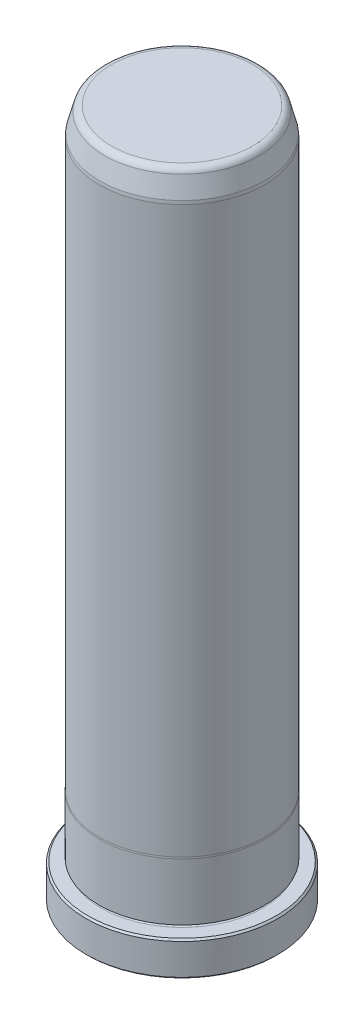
ISO-10303-21;
HEADER;
FILE_DESCRIPTION(('STEP AP214'),'2;1');
FILE_NAME('part.step','',(''),(''),'','','');
FILE_SCHEMA(('AUTOMOTIVE_DESIGN { 1 0 10303 214 1 1 1 1 }'));
ENDSEC;
DATA;
#1=APPLICATION_CONTEXT('core data for automotive mechanical design processes');
#2=APPLICATION_PROTOCOL_DEFINITION('international standard','automotive_design',2000,#1);
#3=PRODUCT_CONTEXT('',#1,'mechanical');
#4=PRODUCT('Part','Part','',(#3));
#5=PRODUCT_RELATED_PRODUCT_CATEGORY('part','',(#4));
#6=PRODUCT_DEFINITION_FORMATION('','',#4);
#7=PRODUCT_DEFINITION_CONTEXT('part definition',#1,'design');
#8=PRODUCT_DEFINITION('design','',#6,#7);
#9=PRODUCT_DEFINITION_SHAPE('','',#8);
#10=(LENGTH_UNIT() NAMED_UNIT(*) SI_UNIT(.MILLI.,.METRE.));
#11=(NAMED_UNIT(*) PLANE_ANGLE_UNIT() SI_UNIT($,.RADIAN.));
#12=(NAMED_UNIT(*) SI_UNIT($,.STERADIAN.) SOLID_ANGLE_UNIT());
#13=UNCERTAINTY_MEASURE_WITH_UNIT(LENGTH_MEASURE(1.E-05),#10,'distance_accuracy_value','');
#14=(GEOMETRIC_REPRESENTATION_CONTEXT(3) GLOBAL_UNCERTAINTY_ASSIGNED_CONTEXT((#13)) GLOBAL_UNIT_ASSIGNED_CONTEXT((#10,
#11,#12)) REPRESENTATION_CONTEXT('',''));
#15=CARTESIAN_POINT('',(0.,0.,0.));
#16=DIRECTION('',(0.,0.,1.));
#17=DIRECTION('',(1.,0.,0.));
#18=AXIS2_PLACEMENT_3D('',#15,#16,#17);
#19=CARTESIAN_POINT('',(0.,-1.15498161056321E-13,0.));
#20=DIRECTION('',(0.,1.,0.));
#21=DIRECTION('',(0.,0.,1.));
#22=AXIS2_PLACEMENT_3D('',#19,#20,#21);
#23=PLANE('',#22);
#24=CARTESIAN_POINT('',(0.,-1.15498161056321E-13,0.));
#25=DIRECTION('',(0.,1.,0.));
#26=DIRECTION('',(0.,0.,1.));
#27=AXIS2_PLACEMENT_3D('',#24,#25,#26);
#28=CIRCLE('',#27,21.7170000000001);
#29=CARTESIAN_POINT('',(0.,-3.42511787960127E-13,21.7170000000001));
#30=VERTEX_POINT('',#29);
#31=EDGE_CURVE('E37',#30,#30,#28,.F.);
#32=ORIENTED_EDGE('',*,*,#31,.T.);
#33=EDGE_LOOP('',(#32));
#34=FACE_BOUND('',#33,.T.);
#35=ADVANCED_FACE('F30',(#34),#23,.F.);
#36=CARTESIAN_POINT('',(0.,0.,0.));
#37=DIRECTION('',(0.,1.,0.));
#38=DIRECTION('',(0.,0.,1.));
#39=AXIS2_PLACEMENT_3D('',#36,#37,#38);
#40=CYLINDRICAL_SURFACE('',#39,22.098);
#41=CARTESIAN_POINT('',(0.,0.380999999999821,0.));
#42=DIRECTION('',(0.,1.,0.));
#43=DIRECTION('',(0.,0.,1.));
#44=AXIS2_PLACEMENT_3D('',#41,#42,#43);
#45=CIRCLE('',#44,22.098);
#46=CARTESIAN_POINT('',(0.,0.38099999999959,22.098));
#47=VERTEX_POINT('',#46);
#48=EDGE_CURVE('E41',#47,#47,#45,.T.);
#49=ORIENTED_EDGE('',*,*,#48,.T.);
#50=EDGE_LOOP('',(#49));
#51=FACE_BOUND('',#50,.T.);
#52=CARTESIAN_POINT('',(0.,7.54379999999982,0.));
#53=DIRECTION('',(0.,-1.,0.));
#54=DIRECTION('',(0.,0.,-1.));
#55=AXIS2_PLACEMENT_3D('',#52,#53,#54);
#56=CIRCLE('',#55,22.098);
#57=CARTESIAN_POINT('',(0.,7.54380000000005,-22.098));
#58=VERTEX_POINT('',#57);
#59=EDGE_CURVE('E45',#58,#58,#56,.T.);
#60=ORIENTED_EDGE('',*,*,#59,.T.);
#61=EDGE_LOOP('',(#60));
#62=FACE_BOUND('',#61,.T.);
#63=ADVANCED_FACE('F118',(#51,#62),#40,.T.);
#64=CARTESIAN_POINT('',(0.,7.92480000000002,-22.098));
#65=DIRECTION('',(0.,-1.,0.));
#66=DIRECTION('',(0.,0.,-1.));
#67=AXIS2_PLACEMENT_3D('',#64,#65,#66);
#68=PLANE('',#67);
#69=CARTESIAN_POINT('',(0.,7.92479999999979,0.));
#70=DIRECTION('',(0.,-1.,0.));
#71=DIRECTION('',(0.,0.,-1.));
#72=AXIS2_PLACEMENT_3D('',#69,#70,#71);
#73=CIRCLE('',#72,21.7170000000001);
#74=CARTESIAN_POINT('',(0.,7.92480000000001,-21.717));
#75=VERTEX_POINT('',#74);
#76=EDGE_CURVE('E10',#75,#75,#73,.F.);
#77=ORIENTED_EDGE('',*,*,#76,.T.);
#78=EDGE_LOOP('',(#77));
#79=FACE_BOUND('',#78,.T.);
#80=CARTESIAN_POINT('',(0.,7.9247999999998,0.));
#81=DIRECTION('',(0.,1.,0.));
#82=DIRECTION('',(0.,0.,1.));
#83=AXIS2_PLACEMENT_3D('',#80,#81,#82);
#84=CIRCLE('',#83,18.6563000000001);
#85=CARTESIAN_POINT('',(0.,7.92479999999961,18.6563000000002));
#86=VERTEX_POINT('',#85);
#87=EDGE_CURVE('E56',#86,#86,#84,.T.);
#88=ORIENTED_EDGE('',*,*,#87,.F.);
#89=EDGE_LOOP('',(#88));
#90=FACE_BOUND('',#89,.T.);
#91=ADVANCED_FACE('F113',(#79,#90),#68,.F.);
#92=CARTESIAN_POINT('',(0.,8.30579999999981,0.));
#93=DIRECTION('',(0.,1.,0.));
#94=DIRECTION('',(0.,0.,1.));
#95=AXIS2_PLACEMENT_3D('',#92,#93,#94);
#96=TOROIDAL_SURFACE('',#95,18.6563000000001,0.381);
#97=CARTESIAN_POINT('',(0.,8.68679999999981,0.));
#98=DIRECTION('',(0.,1.,0.));
#99=DIRECTION('',(0.,0.,1.));
#100=AXIS2_PLACEMENT_3D('',#97,#98,#99);
#101=CIRCLE('',#100,18.6563000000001);
#102=CARTESIAN_POINT('',(0.,8.68679999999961,18.6563000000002));
#103=VERTEX_POINT('',#102);
#104=EDGE_CURVE('E59',#103,#103,#101,.T.);
#105=ORIENTED_EDGE('',*,*,#104,.F.);
#106=EDGE_LOOP('',(#105));
#107=FACE_BOUND('',#106,.T.);
#108=ORIENTED_EDGE('',*,*,#87,.T.);
#109=EDGE_LOOP('',(#108));
#110=FACE_BOUND('',#109,.T.);
#111=ADVANCED_FACE('F107',(#107,#110),#96,.F.);
#112=CARTESIAN_POINT('',(0.,8.6868,-18.6563));
#113=DIRECTION('',(0.,1.,0.));
#114=DIRECTION('',(0.,0.,1.));
#115=AXIS2_PLACEMENT_3D('',#112,#113,#114);
#116=PLANE('',#115);
#117=CARTESIAN_POINT('',(0.,8.6867999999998,0.));
#118=DIRECTION('',(0.,1.,0.));
#119=DIRECTION('',(0.,0.,1.));
#120=AXIS2_PLACEMENT_3D('',#117,#118,#119);
#121=CIRCLE('',#120,19.0627000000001);
#122=CARTESIAN_POINT('',(0.,8.6867999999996,19.0627000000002));
#123=VERTEX_POINT('',#122);
#124=EDGE_CURVE('E62',#123,#123,#121,.T.);
#125=ORIENTED_EDGE('',*,*,#124,.F.);
#126=EDGE_LOOP('',(#125));
#127=FACE_BOUND('',#126,.T.);
#128=ORIENTED_EDGE('',*,*,#104,.T.);
#129=EDGE_LOOP('',(#128));
#130=FACE_BOUND('',#129,.T.);
#131=ADVANCED_FACE('F101',(#127,#130),#116,.F.);
#132=CARTESIAN_POINT('',(0.,0.,0.));
#133=DIRECTION('',(0.,1.,0.));
#134=DIRECTION('',(0.,0.,1.));
#135=AXIS2_PLACEMENT_3D('',#132,#133,#134);
#136=CYLINDRICAL_SURFACE('',#135,19.0627000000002);
#137=CARTESIAN_POINT('',(0.,21.8617630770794,2.28526874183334E-13));
#138=DIRECTION('',(0.,1.,0.));
#139=DIRECTION('',(0.,0.,1.));
#140=AXIS2_PLACEMENT_3D('',#137,#138,#139);
#141=CIRCLE('',#140,19.0627000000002);
#142=CARTESIAN_POINT('',(0.,21.8617630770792,19.0627000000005));
#143=VERTEX_POINT('',#142);
#144=EDGE_CURVE('E65',#143,#143,#141,.T.);
#145=ORIENTED_EDGE('',*,*,#144,.F.);
#146=EDGE_LOOP('',(#145));
#147=FACE_BOUND('',#146,.T.);
#148=ORIENTED_EDGE('',*,*,#124,.T.);
#149=EDGE_LOOP('',(#148));
#150=FACE_BOUND('',#149,.T.);
#151=ADVANCED_FACE('F95',(#147,#150),#136,.T.);
#152=CARTESIAN_POINT('',(0.,21.8617630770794,2.28526874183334E-13));
#153=DIRECTION('',(0.,-1.,0.));
#154=DIRECTION('',(0.,0.,-1.));
#155=AXIS2_PLACEMENT_3D('',#152,#153,#154);
#156=CONICAL_SURFACE('',#155,19.0627000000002,0.0698131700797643);
#157=CARTESIAN_POINT('',(0.,22.2249999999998,2.32323887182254E-13));
#158=DIRECTION('',(0.,1.,0.));
#159=DIRECTION('',(0.,0.,1.));
#160=AXIS2_PLACEMENT_3D('',#157,#158,#159);
#161=CIRCLE('',#160,19.0373000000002);
#162=CARTESIAN_POINT('',(0.,22.2249999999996,19.0373000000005));
#163=VERTEX_POINT('',#162);
#164=EDGE_CURVE('E68',#163,#163,#161,.T.);
#165=ORIENTED_EDGE('',*,*,#164,.F.);
#166=EDGE_LOOP('',(#165));
#167=FACE_BOUND('',#166,.T.);
#168=ORIENTED_EDGE('',*,*,#144,.T.);
#169=EDGE_LOOP('',(#168));
#170=FACE_BOUND('',#169,.T.);
#171=ADVANCED_FACE('F89',(#167,#170),#156,.T.);
#172=CARTESIAN_POINT('',(0.,0.,0.));
#173=DIRECTION('',(0.,1.,0.));
#174=DIRECTION('',(0.,0.,1.));
#175=AXIS2_PLACEMENT_3D('',#172,#173,#174);
#176=CYLINDRICAL_SURFACE('',#175,19.0373000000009);
#177=CARTESIAN_POINT('',(0.,152.4,1.59307808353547E-12));
#178=DIRECTION('',(0.,1.,0.));
#179=DIRECTION('',(0.,0.,1.));
#180=AXIS2_PLACEMENT_3D('',#177,#178,#179);
#181=CIRCLE('',#180,19.0373000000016);
#182=CARTESIAN_POINT('',(0.,152.4,19.0373000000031));
#183=VERTEX_POINT('',#182);
#184=EDGE_CURVE('E71',#183,#183,#181,.T.);
#185=ORIENTED_EDGE('',*,*,#184,.F.);
#186=EDGE_LOOP('',(#185));
#187=FACE_BOUND('',#186,.T.);
#188=ORIENTED_EDGE('',*,*,#164,.T.);
#189=EDGE_LOOP('',(#188));
#190=FACE_BOUND('',#189,.T.);
#191=ADVANCED_FACE('F83',(#187,#190),#176,.T.);
#192=CARTESIAN_POINT('',(0.,152.4,1.59307808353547E-12));
#193=DIRECTION('',(0.,-1.,0.));
#194=DIRECTION('',(0.,0.,-1.));
#195=AXIS2_PLACEMENT_3D('',#192,#193,#194);
#196=CONICAL_SURFACE('',#195,19.0373000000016,0.0872664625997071);
#197=CARTESIAN_POINT('',(0.,153.162,1.60104347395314E-12));
#198=DIRECTION('',(0.,1.,0.));
#199=DIRECTION('',(0.,0.,1.));
#200=AXIS2_PLACEMENT_3D('',#197,#198,#199);
#201=CIRCLE('',#200,18.9706336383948);
#202=CARTESIAN_POINT('',(0.,153.162,18.9706336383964));
#203=VERTEX_POINT('',#202);
#204=EDGE_CURVE('E74',#203,#203,#201,.T.);
#205=ORIENTED_EDGE('',*,*,#204,.F.);
#206=EDGE_LOOP('',(#205));
#207=FACE_BOUND('',#206,.T.);
#208=ORIENTED_EDGE('',*,*,#184,.T.);
#209=EDGE_LOOP('',(#208));
#210=FACE_BOUND('',#209,.T.);
#211=ADVANCED_FACE('F80',(#207,#210),#196,.T.);
#212=CARTESIAN_POINT('',(0.,153.162,1.60104347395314E-12));
#213=DIRECTION('',(0.,-1.,0.));
#214=DIRECTION('',(0.,0.,-1.));
#215=AXIS2_PLACEMENT_3D('',#212,#213,#214);
#216=CONICAL_SURFACE('',#215,18.9706336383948,0.26179938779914);
#217=CARTESIAN_POINT('',(0.,157.5733752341,1.64715676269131E-12));
#218=DIRECTION('',(0.,1.,0.));
#219=DIRECTION('',(0.,0.,1.));
#220=AXIS2_PLACEMENT_3D('',#217,#218,#219);
#221=CIRCLE('',#220,17.788609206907);
#222=CARTESIAN_POINT('',(0.,157.5733752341,17.7886092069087));
#223=VERTEX_POINT('',#222);
#224=EDGE_CURVE('E50',#223,#223,#221,.F.);
#225=ORIENTED_EDGE('',*,*,#224,.T.);
#226=EDGE_LOOP('',(#225));
#227=FACE_BOUND('',#226,.T.);
#228=ORIENTED_EDGE('',*,*,#204,.T.);
#229=EDGE_LOOP('',(#228));
#230=FACE_BOUND('',#229,.T.);
#231=ADVANCED_FACE('F78',(#227,#230),#216,.T.);
#232=CARTESIAN_POINT('',(0.,158.75,-17.4733335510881));
#233=DIRECTION('',(0.,-1.,0.));
#234=DIRECTION('',(0.,0.,-1.));
#235=AXIS2_PLACEMENT_3D('',#232,#233,#234);
#236=PLANE('',#235);
#237=CARTESIAN_POINT('',(0.,158.75,1.65945633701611E-12));
#238=DIRECTION('',(0.,-1.,0.));
#239=DIRECTION('',(0.,0.,-1.));
#240=AXIS2_PLACEMENT_3D('',#237,#238,#239);
#241=CIRCLE('',#240,16.2552019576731);
#242=CARTESIAN_POINT('',(0.,158.75,-16.2552019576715));
#243=VERTEX_POINT('',#242);
#244=EDGE_CURVE('E53',#243,#243,#241,.F.);
#245=ORIENTED_EDGE('',*,*,#244,.T.);
#246=EDGE_LOOP('',(#245));
#247=FACE_BOUND('',#246,.T.);
#248=ADVANCED_FACE('F133',(#247),#236,.F.);
#249=CARTESIAN_POINT('',(0.,157.1625,1.64286177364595E-12));
#250=DIRECTION('',(0.,-1.,0.));
#251=DIRECTION('',(0.,0.,-1.));
#252=AXIS2_PLACEMENT_3D('',#249,#250,#251);
#253=TOROIDAL_SURFACE('',#252,16.2552019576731,1.5875);
#254=ORIENTED_EDGE('',*,*,#224,.F.);
#255=EDGE_LOOP('',(#254));
#256=FACE_BOUND('',#255,.T.);
#257=ORIENTED_EDGE('',*,*,#244,.F.);
#258=EDGE_LOOP('',(#257));
#259=FACE_BOUND('',#258,.T.);
#260=ADVANCED_FACE('F130',(#256,#259),#253,.T.);
#261=CARTESIAN_POINT('',(0.,0.380999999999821,0.));
#262=DIRECTION('',(0.,1.,0.));
#263=DIRECTION('',(0.,0.,1.));
#264=AXIS2_PLACEMENT_3D('',#261,#262,#263);
#265=CONICAL_SURFACE('',#264,22.098,0.785398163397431);
#266=ORIENTED_EDGE('',*,*,#31,.F.);
#267=EDGE_LOOP('',(#266));
#268=FACE_BOUND('',#267,.T.);
#269=ORIENTED_EDGE('',*,*,#48,.F.);
#270=EDGE_LOOP('',(#269));
#271=FACE_BOUND('',#270,.T.);
#272=ADVANCED_FACE('F132',(#268,#271),#265,.T.);
#273=CARTESIAN_POINT('',(0.,7.92479999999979,0.));
#274=DIRECTION('',(0.,-1.,0.));
#275=DIRECTION('',(0.,0.,-1.));
#276=AXIS2_PLACEMENT_3D('',#273,#274,#275);
#277=CONICAL_SURFACE('',#276,21.7170000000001,0.785398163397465);
#278=ORIENTED_EDGE('',*,*,#59,.F.);
#279=EDGE_LOOP('',(#278));
#280=FACE_BOUND('',#279,.T.);
#281=ORIENTED_EDGE('',*,*,#76,.F.);
#282=EDGE_LOOP('',(#281));
#283=FACE_BOUND('',#282,.T.);
#284=ADVANCED_FACE('F32',(#280,#283),#277,.T.);
#285=CLOSED_SHELL('',(#35,#63,#91,#111,#131,#151,#171,#191,#211,#231,#248,#260,#272,#284));
#286=MANIFOLD_SOLID_BREP('B2',#285);
#287=ADVANCED_BREP_SHAPE_REPRESENTATION('',(#18,#286),#14);
#288=SHAPE_DEFINITION_REPRESENTATION(#9,#287);
ENDSEC;
END-ISO-10303-21;
